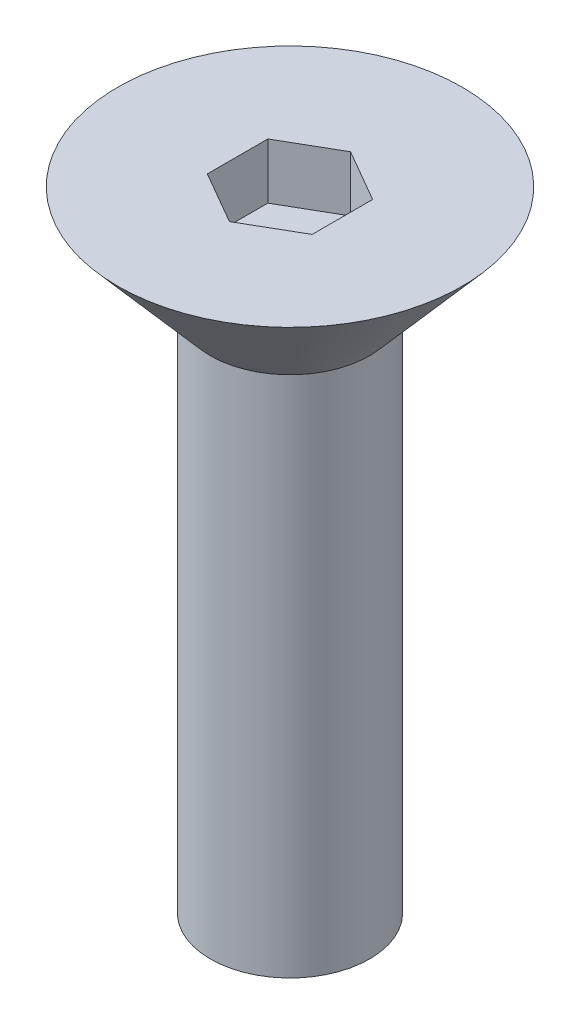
from build123d import *

# Parameters (mm, degrees)
HEXCUT_DEPTH = 1.68402


with BuildPart() as part:
    # Sketch1 → Screw (revolve)
    with BuildSketch(Plane.XY, mode=Mode.PRIVATE) as screw_sk:
        Polygon((0, 0), (5.2197, 0), (2.413, -3.228739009), (2.413, -19.052939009), (0, -19.052939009), align=None)
    revolve(screw_sk.sketch.rotate(Axis((0, 25.4, 0), (0, -1, 0)), 90), axis=Axis((0, 25.4, 0), (0, -1, 0)))

    # Sketch2 → HexCut (cut)
    with BuildSketch(Plane(origin=(0, 0, 0), x_dir=(-1, 0, 0), z_dir=(0, 1, 0))):
        Polygon((-1.5875, -0.916543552), (-1.5875, 0.916543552), (0, 1.833087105), (1.5875, 0.916543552), (1.5875, -0.916543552), (0, -1.833087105), align=None)
    extrude(amount=-HEXCUT_DEPTH, mode=Mode.SUBTRACT)


solid = part.part
